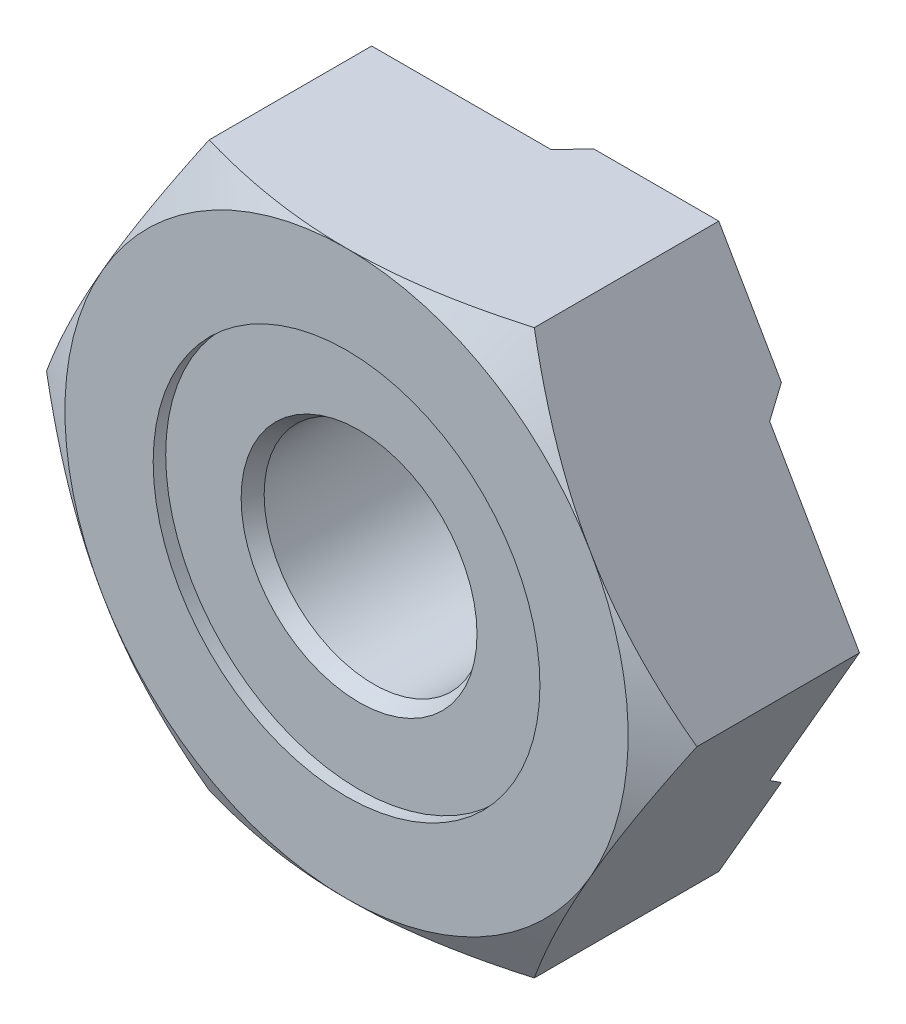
from build123d import *

# Parameters (mm, degrees)
BASENUT_DEPTH                 = 3.5
SKETCH2_W                     = 0.2
SKETCH2_H                     = 3.09
SKETCH3_OUTSIDE_W             = 15.23
SKETCH3_OUTSIDE_H             = 13.838
SKETCH3_OUTSIDE_R             = 2.985
CUT_EXTRUDE1_DEPTH            = 0.5
EXTRUDE1_DEPTH                = 0.35
DRAFT1_ANGLE                  = 25
CIRPATTERN1_COUNT             = 3
DRAFT1_OF_CIRPATTERN1_2_ANGLE = 25
DRAFT1_OF_CIRPATTERN1_3_ANGLE = 25
SKETCH7_R                     = 1.75
HOLE_DEPTH                    = 10.396766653
ENDCHAMFER_SIZE               = 0.134715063
ENDCHAMFER_SIZE2              = 0.233333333
ENDCHAMFER_EDGE_2_SIZE2       = 0.233333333
ENDCHAMFER_EDGE_2_SIZE        = 0.134715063


with BuildPart() as part:
    # Sketch1 → BaseNut (new body)
    with BuildSketch(Plane.XY):
        Polygon((2.598076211, -4.5), (5.196152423, 0), (2.598076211, 4.5), (-2.598076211, 4.5), (-5.196152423, 0), (-2.598076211, -4.5), align=None)
    extrude(amount=-BASENUT_DEPTH)

    # Sketch2 → Bearing-Face (revolve, cut)
    with BuildSketch(Plane(origin=(15.098076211, 0, -9.901923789), x_dir=(0, 0, 1), z_dir=(0, 1, 0))):
        Polygon((9.5, -20.294228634), (9.901923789, -19.598076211), (9.901923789, -20.294228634), align=None)
        with Locations((9.801923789, -16.643076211)):
            Rectangle(SKETCH2_W, SKETCH2_H)
    revolve(axis=Axis((0, 0, -9.901923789), (0, 0, 1)), mode=Mode.SUBTRACT)

    # Sketch3 outside → Cut-Extrude1 (cut)
    with BuildSketch(Plane(origin=(1.076118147, -0.6707952, -3.5), x_dir=(-1, 0, 0), z_dir=(0, 0, -1))):
        with Locations((1.076, 0.671)):
            Rectangle(SKETCH3_OUTSIDE_W, SKETCH3_OUTSIDE_H)
        with Locations((1.076118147, 0.6707952)):
            Circle(SKETCH3_OUTSIDE_R, mode=Mode.SUBTRACT)
    extrude(amount=-CUT_EXTRUDE1_DEPTH, mode=Mode.SUBTRACT)

    # Sketch6 → Extrude1 (add)
    with BuildSketch(Plane(origin=(0.291702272, 0.238088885, -3), x_dir=(0.5000000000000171, 0.8660254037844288, 0), z_dir=(0, 0, -1))):
        Polygon((-2.95011837, 4.366422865), (-3.95011837, 2.634372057), (-0.95011837, 4.366422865), align=None)
    extrude1 = extrude(amount=EXTRUDE1_DEPTH)

    # Draft1
    draft1_faces = [part.faces().sort_by_distance(p)[0] for p in [
        (2.098076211, -3.633974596, -3.175),
    ]]
    draft(draft1_faces, Plane(origin=(2.598076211, -4.5, -3.35), x_dir=(-1, 0, 0), z_dir=(0, 0, -1)), DRAFT1_ANGLE)

    # CirPattern1: Extrude1 ×3 about axis
    cirpattern1_axis = Axis((0, 0, 0), (0, 0, 1))
    for i in range(1, CIRPATTERN1_COUNT):
        add(extrude1.rotate(cirpattern1_axis, i * 360 / CIRPATTERN1_COUNT))

    # Draft1 of CirPattern1 2
    draft1_of_cirpattern1_2_faces = [part.faces().sort_by_distance(p)[0] for p in [
        (2.098076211, 3.633974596, -3.175),
    ]]
    draft(draft1_of_cirpattern1_2_faces, Plane(origin=(2.598076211, 4.5, -3.35), x_dir=(0.4999999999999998, -0.8660254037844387, 0), z_dir=(0, 0, -1)), DRAFT1_OF_CIRPATTERN1_2_ANGLE)

    # Draft1 of CirPattern1 3
    draft1_of_cirpattern1_3_faces = [part.faces().sort_by_distance(p)[0] for p in [
        (-4.196152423, 0, -3.175),
    ]]
    draft(draft1_of_cirpattern1_3_faces, Plane(origin=(-5.196152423, 0, -3.35), x_dir=(0.5000000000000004, 0.8660254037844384, 0), z_dir=(0, 0, -1)), DRAFT1_OF_CIRPATTERN1_3_ANGLE)

    # Sketch7 → Hole (cut, through all)
    with BuildSketch(Plane(origin=(-1.634079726, 0.921914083, -3.5), x_dir=(-1, 0, 0), z_dir=(0, 0, -1))):
        with Locations((-1.634079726, -0.921914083)):
            Circle(SKETCH7_R)
    extrude(amount=-HOLE_DEPTH, mode=Mode.SUBTRACT)

    # EndChamfer
    endchamfer_edges = [part.edges().sort_by_distance(p)[0] for p in [
        (1.75, 0, -0.2),
    ]]
    endchamfer_side = [part.faces().sort_by_distance(p)[0] for p in [
        (3.002601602, 0, -0.2),
    ]]
    chamfer(endchamfer_edges, length=ENDCHAMFER_SIZE, length2=ENDCHAMFER_SIZE2, reference=endchamfer_side[0])

    # EndChamfer edge 2
    endchamfer_edge_2_edges = [part.edges().sort_by_distance(p)[0] for p in [
        (1.75, 0, -3.5),
    ]]
    chamfer(endchamfer_edge_2_edges, length=ENDCHAMFER_EDGE_2_SIZE, length2=ENDCHAMFER_EDGE_2_SIZE2)


solid = part.part
